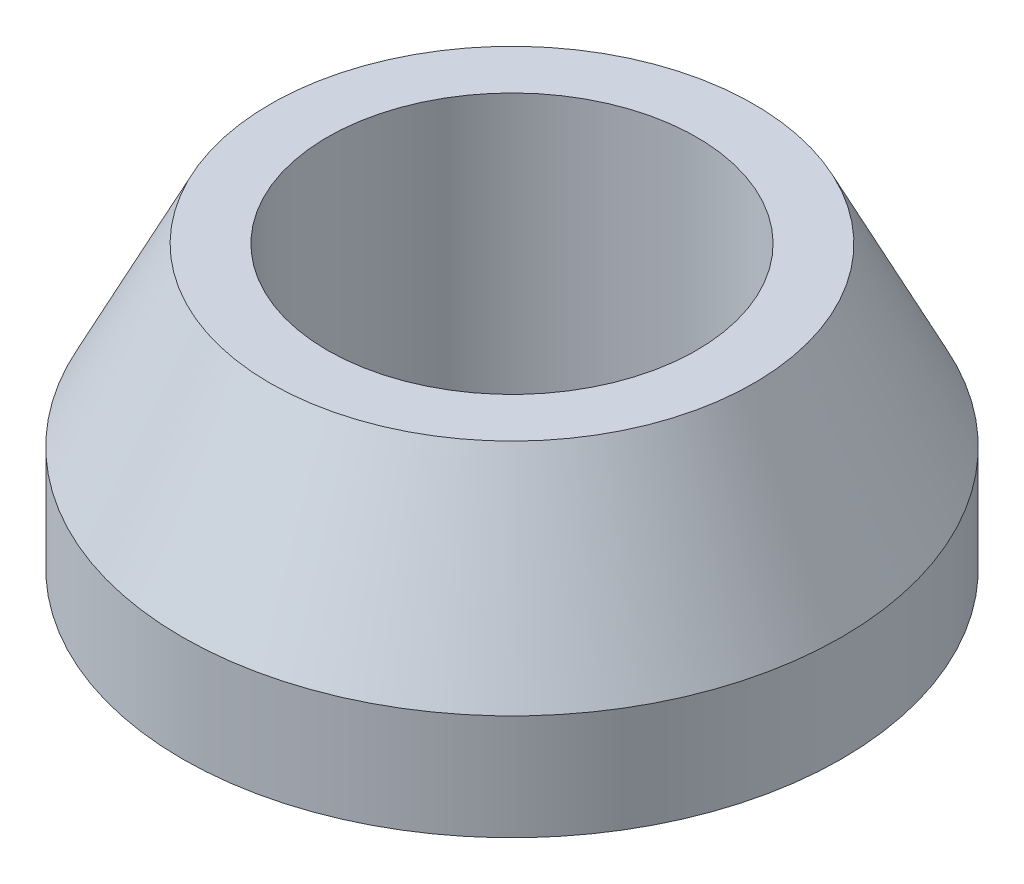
from build123d import *

# Parameters (mm, degrees)
SKETCH_1_R      = 3.75
SKETCH_1_R_2    = 2.1
EXTRUDE_1_DEPTH = 3.2
CHAMFER_1_SIZE  = 2
CHAMFER_1_SIZE2 = 1


with BuildPart() as part:
    # Sketch 1 → Extrude 1 (new body)
    with BuildSketch(Plane(origin=(0, 0, 0), x_dir=(1, 0, 0), z_dir=(0, 1, 0))):
        with Locations(Location((0, 0, 0), (0, 0, 270))):
            Circle(SKETCH_1_R)
        with Locations(Location((0, 0, 0), (0, 0, 270))):
            Circle(SKETCH_1_R_2, mode=Mode.SUBTRACT)
    extrude(amount=EXTRUDE_1_DEPTH)

    # Chamfer 1
    chamfer_1_edges = [part.edges().sort_by_distance(p)[0] for p in [
        (0, 3.2, -3.75),
    ]]
    chamfer_1_side = [part.faces().sort_by_distance(p)[0] for p in [
        (0, 1.6, -3.75),
    ]]
    chamfer(chamfer_1_edges, length=CHAMFER_1_SIZE, length2=CHAMFER_1_SIZE2, reference=chamfer_1_side[0])


solid = part.part
